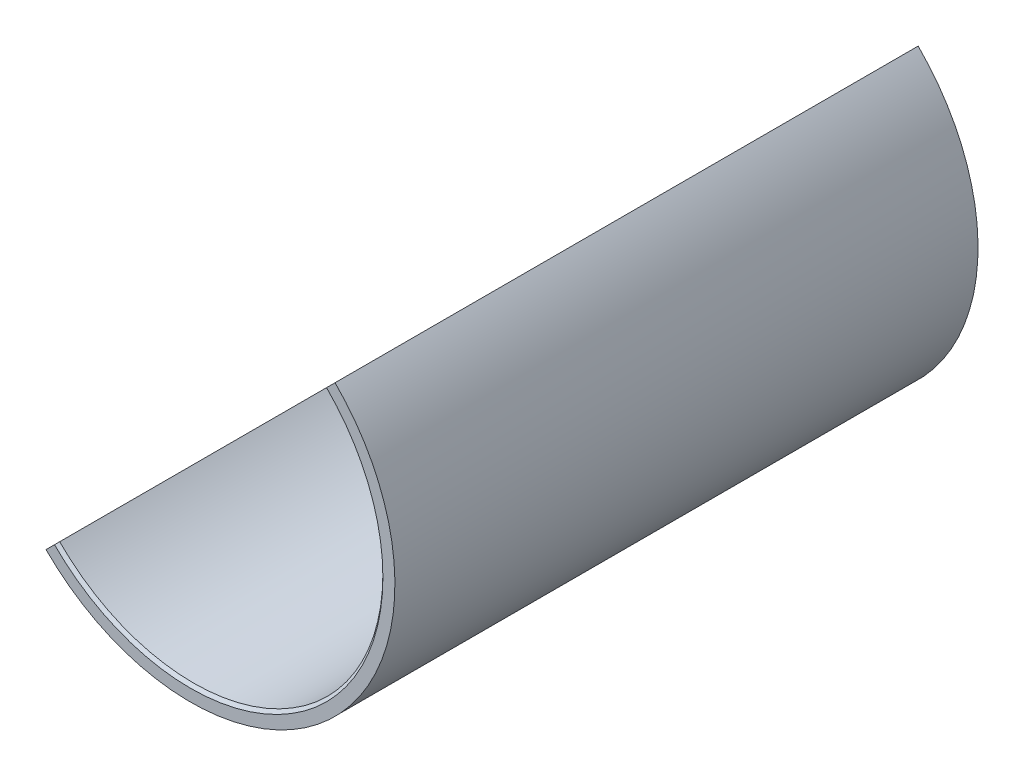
ISO-10303-21;
HEADER;
FILE_DESCRIPTION(('STEP AP214'),'2;1');
FILE_NAME('part.step','',(''),(''),'','','');
FILE_SCHEMA(('AUTOMOTIVE_DESIGN { 1 0 10303 214 1 1 1 1 }'));
ENDSEC;
DATA;
#1=APPLICATION_CONTEXT('core data for automotive mechanical design processes');
#2=APPLICATION_PROTOCOL_DEFINITION('international standard','automotive_design',2000,#1);
#3=PRODUCT_CONTEXT('',#1,'mechanical');
#4=PRODUCT('Part','Part','',(#3));
#5=PRODUCT_RELATED_PRODUCT_CATEGORY('part','',(#4));
#6=PRODUCT_DEFINITION_FORMATION('','',#4);
#7=PRODUCT_DEFINITION_CONTEXT('part definition',#1,'design');
#8=PRODUCT_DEFINITION('design','',#6,#7);
#9=PRODUCT_DEFINITION_SHAPE('','',#8);
#10=(LENGTH_UNIT() NAMED_UNIT(*) SI_UNIT(.MILLI.,.METRE.));
#11=(NAMED_UNIT(*) PLANE_ANGLE_UNIT() SI_UNIT($,.RADIAN.));
#12=(NAMED_UNIT(*) SI_UNIT($,.STERADIAN.) SOLID_ANGLE_UNIT());
#13=UNCERTAINTY_MEASURE_WITH_UNIT(LENGTH_MEASURE(1.E-05),#10,'distance_accuracy_value','');
#14=(GEOMETRIC_REPRESENTATION_CONTEXT(3) GLOBAL_UNCERTAINTY_ASSIGNED_CONTEXT((#13)) GLOBAL_UNIT_ASSIGNED_CONTEXT((#10,
#11,#12)) REPRESENTATION_CONTEXT('',''));
#15=CARTESIAN_POINT('',(0.,0.,0.));
#16=DIRECTION('',(0.,0.,1.));
#17=DIRECTION('',(1.,0.,0.));
#18=AXIS2_PLACEMENT_3D('',#15,#16,#17);
#19=CARTESIAN_POINT('',(0.,0.,-96.9999999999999));
#20=DIRECTION('',(0.,0.,1.));
#21=DIRECTION('',(1.,0.,0.));
#22=AXIS2_PLACEMENT_3D('',#19,#20,#21);
#23=CYLINDRICAL_SURFACE('',#22,34.);
#24=DIRECTION('',(0.,0.,1.));
#25=VECTOR('',#24,1.);
#26=CARTESIAN_POINT('',(24.0416305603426,24.0416305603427,-97.));
#27=LINE('',#26,#25);
#28=CARTESIAN_POINT('',(24.0416305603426,24.0416305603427,0.));
#29=VERTEX_POINT('',#28);
#30=CARTESIAN_POINT('',(24.0416305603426,24.0416305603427,-97.));
#31=VERTEX_POINT('',#30);
#32=EDGE_CURVE('E91',#29,#31,#27,.F.);
#33=ORIENTED_EDGE('',*,*,#32,.F.);
#34=CARTESIAN_POINT('',(0.,0.,0.));
#35=DIRECTION('',(0.,0.,1.));
#36=DIRECTION('',(1.,0.,0.));
#37=AXIS2_PLACEMENT_3D('',#34,#35,#36);
#38=CIRCLE('',#37,34.);
#39=CARTESIAN_POINT('',(-24.0416305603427,-24.0416305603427,0.));
#40=VERTEX_POINT('',#39);
#41=EDGE_CURVE('E90',#40,#29,#38,.T.);
#42=ORIENTED_EDGE('',*,*,#41,.F.);
#43=DIRECTION('',(0.,0.,1.));
#44=VECTOR('',#43,1.);
#45=CARTESIAN_POINT('',(-24.0416305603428,-24.0416305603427,-97.));
#46=LINE('',#45,#44);
#47=CARTESIAN_POINT('',(-24.0416305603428,-24.0416305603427,-97.));
#48=VERTEX_POINT('',#47);
#49=EDGE_CURVE('E76',#48,#40,#46,.T.);
#50=ORIENTED_EDGE('',*,*,#49,.F.);
#51=CARTESIAN_POINT('',(0.,0.,-96.9999999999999));
#52=DIRECTION('',(0.,0.,1.));
#53=DIRECTION('',(1.,0.,0.));
#54=AXIS2_PLACEMENT_3D('',#51,#52,#53);
#55=CIRCLE('',#54,34.);
#56=EDGE_CURVE('E88',#48,#31,#55,.T.);
#57=ORIENTED_EDGE('',*,*,#56,.T.);
#58=EDGE_LOOP('',(#33,#42,#50,#57));
#59=FACE_BOUND('',#58,.T.);
#60=ADVANCED_FACE('F24',(#59),#23,.T.);
#61=CARTESIAN_POINT('',(0.,0.,-96.9999999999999));
#62=DIRECTION('',(0.,0.,1.));
#63=DIRECTION('',(1.,0.,0.));
#64=AXIS2_PLACEMENT_3D('',#61,#62,#63);
#65=PLANE('',#64);
#66=ORIENTED_EDGE('',*,*,#56,.F.);
#67=DIRECTION('',(0.707106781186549,0.707106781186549,0.));
#68=VECTOR('',#67,1.);
#69=CARTESIAN_POINT('',(30.,30.0000000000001,-97.));
#70=LINE('',#69,#68);
#71=CARTESIAN_POINT('',(-22.6274169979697,-22.6274169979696,-97.));
#72=VERTEX_POINT('',#71);
#73=EDGE_CURVE('E73',#48,#72,#70,.T.);
#74=ORIENTED_EDGE('',*,*,#73,.T.);
#75=CARTESIAN_POINT('',(0.,0.,-96.9999999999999));
#76=DIRECTION('',(0.,0.,1.));
#77=DIRECTION('',(1.,0.,0.));
#78=AXIS2_PLACEMENT_3D('',#75,#76,#77);
#79=CIRCLE('',#78,32.);
#80=CARTESIAN_POINT('',(22.6274169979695,22.6274169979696,-97.));
#81=VERTEX_POINT('',#80);
#82=EDGE_CURVE('E108',#72,#81,#79,.T.);
#83=ORIENTED_EDGE('',*,*,#82,.T.);
#84=EDGE_CURVE('E38',#81,#31,#70,.T.);
#85=ORIENTED_EDGE('',*,*,#84,.T.);
#86=EDGE_LOOP('',(#66,#74,#83,#85));
#87=FACE_BOUND('',#86,.T.);
#88=ADVANCED_FACE('F94',(#87),#65,.F.);
#89=CARTESIAN_POINT('',(0.,0.,0.));
#90=DIRECTION('',(0.,0.,1.));
#91=DIRECTION('',(1.,0.,0.));
#92=AXIS2_PLACEMENT_3D('',#89,#90,#91);
#93=PLANE('',#92);
#94=DIRECTION('',(0.707106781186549,0.707106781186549,0.));
#95=VECTOR('',#94,1.);
#96=CARTESIAN_POINT('',(30.,30.,0.));
#97=LINE('',#96,#95);
#98=CARTESIAN_POINT('',(-22.6274169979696,-22.6274169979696,0.));
#99=VERTEX_POINT('',#98);
#100=EDGE_CURVE('E148',#40,#99,#97,.T.);
#101=ORIENTED_EDGE('',*,*,#100,.F.);
#102=ORIENTED_EDGE('',*,*,#41,.T.);
#103=CARTESIAN_POINT('',(22.6274169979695,22.6274169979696,0.));
#104=VERTEX_POINT('',#103);
#105=EDGE_CURVE('E152',#104,#29,#97,.T.);
#106=ORIENTED_EDGE('',*,*,#105,.F.);
#107=CARTESIAN_POINT('',(0.,0.,0.));
#108=DIRECTION('',(0.,0.,1.));
#109=DIRECTION('',(1.,0.,0.));
#110=AXIS2_PLACEMENT_3D('',#107,#108,#109);
#111=CIRCLE('',#110,32.);
#112=EDGE_CURVE('E105',#104,#99,#111,.F.);
#113=ORIENTED_EDGE('',*,*,#112,.T.);
#114=EDGE_LOOP('',(#101,#102,#106,#113));
#115=FACE_BOUND('',#114,.T.);
#116=ADVANCED_FACE('F134',(#115),#93,.T.);
#117=CARTESIAN_POINT('',(0.,0.,-96.9999999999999));
#118=DIRECTION('',(0.,0.,1.));
#119=DIRECTION('',(1.,0.,0.));
#120=AXIS2_PLACEMENT_3D('',#117,#118,#119);
#121=CYLINDRICAL_SURFACE('',#120,31.5);
#122=CARTESIAN_POINT('',(0.,0.,-0.499999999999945));
#123=DIRECTION('',(0.,0.,1.));
#124=DIRECTION('',(1.,0.,0.));
#125=AXIS2_PLACEMENT_3D('',#122,#123,#124);
#126=CIRCLE('',#125,31.5);
#127=CARTESIAN_POINT('',(-22.2738636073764,-22.2738636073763,-0.499999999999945));
#128=VERTEX_POINT('',#127);
#129=CARTESIAN_POINT('',(22.2738636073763,22.2738636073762,-0.500000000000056));
#130=VERTEX_POINT('',#129);
#131=EDGE_CURVE('E98',#128,#130,#126,.T.);
#132=ORIENTED_EDGE('',*,*,#131,.T.);
#133=DIRECTION('',(0.,0.,1.));
#134=VECTOR('',#133,1.);
#135=CARTESIAN_POINT('',(22.2738636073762,22.2738636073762,-97.));
#136=LINE('',#135,#134);
#137=CARTESIAN_POINT('',(22.2738636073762,22.2738636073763,-96.5));
#138=VERTEX_POINT('',#137);
#139=EDGE_CURVE('E82',#130,#138,#136,.F.);
#140=ORIENTED_EDGE('',*,*,#139,.T.);
#141=CARTESIAN_POINT('',(0.,0.,-96.4999999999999));
#142=DIRECTION('',(0.,0.,1.));
#143=DIRECTION('',(1.,0.,0.));
#144=AXIS2_PLACEMENT_3D('',#141,#142,#143);
#145=CIRCLE('',#144,31.5);
#146=CARTESIAN_POINT('',(-22.2738636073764,-22.2738636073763,-96.5));
#147=VERTEX_POINT('',#146);
#148=EDGE_CURVE('E95',#138,#147,#145,.F.);
#149=ORIENTED_EDGE('',*,*,#148,.T.);
#150=DIRECTION('',(0.,0.,1.));
#151=VECTOR('',#150,1.);
#152=CARTESIAN_POINT('',(-22.2738636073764,-22.2738636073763,-97.));
#153=LINE('',#152,#151);
#154=EDGE_CURVE('E45',#147,#128,#153,.T.);
#155=ORIENTED_EDGE('',*,*,#154,.T.);
#156=EDGE_LOOP('',(#132,#140,#149,#155));
#157=FACE_BOUND('',#156,.T.);
#158=ADVANCED_FACE('F115',(#157),#121,.F.);
#159=CARTESIAN_POINT('',(0.,0.,-0.499999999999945));
#160=DIRECTION('',(0.,0.,1.));
#161=DIRECTION('',(1.,0.,0.));
#162=AXIS2_PLACEMENT_3D('',#159,#160,#161);
#163=CONICAL_SURFACE('',#162,31.5,0.785398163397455);
#164=DIRECTION('',(0.500000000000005,0.500000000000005,0.707106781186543));
#165=VECTOR('',#164,1.);
#166=CARTESIAN_POINT('',(0.,0.,-31.9999999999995));
#167=LINE('',#166,#165);
#168=EDGE_CURVE('E117',#130,#104,#167,.T.);
#169=ORIENTED_EDGE('',*,*,#168,.F.);
#170=ORIENTED_EDGE('',*,*,#131,.F.);
#171=DIRECTION('',(0.500000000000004,0.500000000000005,-0.707106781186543));
#172=VECTOR('',#171,1.);
#173=CARTESIAN_POINT('',(0.,0.,-31.9999999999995));
#174=LINE('',#173,#172);
#175=EDGE_CURVE('E92',#99,#128,#174,.T.);
#176=ORIENTED_EDGE('',*,*,#175,.F.);
#177=ORIENTED_EDGE('',*,*,#112,.F.);
#178=EDGE_LOOP('',(#169,#170,#176,#177));
#179=FACE_BOUND('',#178,.T.);
#180=ADVANCED_FACE('F121',(#179),#163,.F.);
#181=CARTESIAN_POINT('',(0.,0.,-96.9999999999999));
#182=DIRECTION('',(0.,0.,-1.));
#183=DIRECTION('',(-1.,0.,0.));
#184=AXIS2_PLACEMENT_3D('',#181,#182,#183);
#185=CONICAL_SURFACE('',#184,32.,0.785398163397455);
#186=DIRECTION('',(-0.500000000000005,-0.500000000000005,-0.707106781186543));
#187=VECTOR('',#186,1.);
#188=CARTESIAN_POINT('',(-1.38777878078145E-13,0.,-65.0000000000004));
#189=LINE('',#188,#187);
#190=EDGE_CURVE('E11',#147,#72,#189,.T.);
#191=ORIENTED_EDGE('',*,*,#190,.F.);
#192=ORIENTED_EDGE('',*,*,#148,.F.);
#193=DIRECTION('',(-0.500000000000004,-0.500000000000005,0.707106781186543));
#194=VECTOR('',#193,1.);
#195=CARTESIAN_POINT('',(-1.38777878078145E-13,0.,-65.0000000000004));
#196=LINE('',#195,#194);
#197=EDGE_CURVE('E31',#81,#138,#196,.T.);
#198=ORIENTED_EDGE('',*,*,#197,.F.);
#199=ORIENTED_EDGE('',*,*,#82,.F.);
#200=EDGE_LOOP('',(#191,#192,#198,#199));
#201=FACE_BOUND('',#200,.T.);
#202=ADVANCED_FACE('F119',(#201),#185,.F.);
#203=CARTESIAN_POINT('',(30.,30.0000000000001,-97.));
#204=DIRECTION('',(0.707106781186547,-0.707106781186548,0.));
#205=DIRECTION('',(0.707106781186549,0.707106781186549,0.));
#206=AXIS2_PLACEMENT_3D('',#203,#204,#205);
#207=PLANE('',#206);
#208=ORIENTED_EDGE('',*,*,#32,.T.);
#209=ORIENTED_EDGE('',*,*,#84,.F.);
#210=ORIENTED_EDGE('',*,*,#197,.T.);
#211=ORIENTED_EDGE('',*,*,#139,.F.);
#212=ORIENTED_EDGE('',*,*,#168,.T.);
#213=ORIENTED_EDGE('',*,*,#105,.T.);
#214=EDGE_LOOP('',(#208,#209,#210,#211,#212,#213));
#215=FACE_BOUND('',#214,.T.);
#216=ADVANCED_FACE('F110',(#215),#207,.F.);
#217=ORIENTED_EDGE('',*,*,#49,.T.);
#218=ORIENTED_EDGE('',*,*,#100,.T.);
#219=ORIENTED_EDGE('',*,*,#175,.T.);
#220=ORIENTED_EDGE('',*,*,#154,.F.);
#221=ORIENTED_EDGE('',*,*,#190,.T.);
#222=ORIENTED_EDGE('',*,*,#73,.F.);
#223=EDGE_LOOP('',(#217,#218,#219,#220,#221,#222));
#224=FACE_BOUND('',#223,.T.);
#225=ADVANCED_FACE('F75',(#224),#207,.F.);
#226=CLOSED_SHELL('',(#60,#88,#116,#158,#180,#202,#216,#225));
#227=MANIFOLD_SOLID_BREP('B2',#226);
#228=ADVANCED_BREP_SHAPE_REPRESENTATION('',(#18,#227),#14);
#229=SHAPE_DEFINITION_REPRESENTATION(#9,#228);
ENDSEC;
END-ISO-10303-21;
